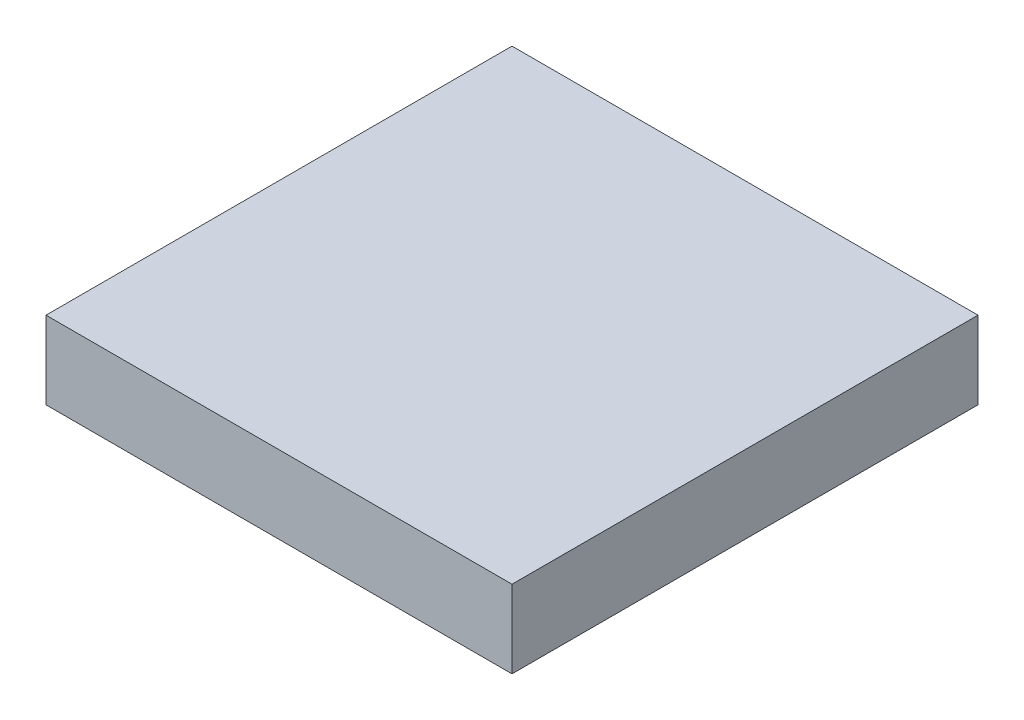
from build123d import *

# Parameters (mm, degrees)
ESQUISSE1_W      = 30
ESQUISSE1_H      = 5
EXTRUSION1_DEPTH = 30


with BuildPart() as part:
    # Esquisse1 → Extrusion1 (new body)
    with BuildSketch(Plane.XY):
        with Locations((15, 2.5)):
            Rectangle(ESQUISSE1_W, ESQUISSE1_H)
    extrude(amount=EXTRUSION1_DEPTH)


solid = part.part
